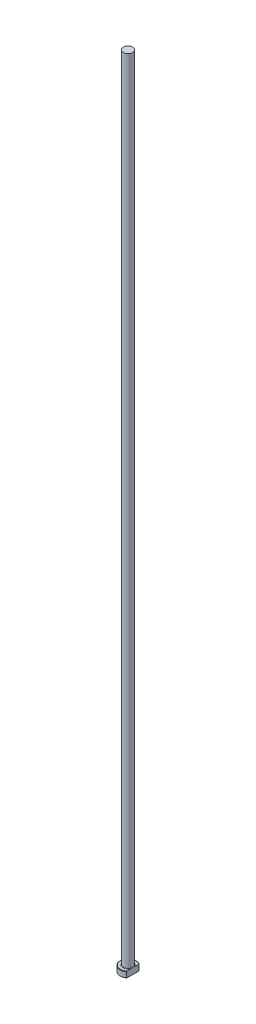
ISO-10303-21;
HEADER;
FILE_DESCRIPTION(('STEP AP214'),'2;1');
FILE_NAME('part.step','',(''),(''),'','','');
FILE_SCHEMA(('AUTOMOTIVE_DESIGN { 1 0 10303 214 1 1 1 1 }'));
ENDSEC;
DATA;
#1=APPLICATION_CONTEXT('core data for automotive mechanical design processes');
#2=APPLICATION_PROTOCOL_DEFINITION('international standard','automotive_design',2000,#1);
#3=PRODUCT_CONTEXT('',#1,'mechanical');
#4=PRODUCT('Part','Part','',(#3));
#5=PRODUCT_RELATED_PRODUCT_CATEGORY('part','',(#4));
#6=PRODUCT_DEFINITION_FORMATION('','',#4);
#7=PRODUCT_DEFINITION_CONTEXT('part definition',#1,'design');
#8=PRODUCT_DEFINITION('design','',#6,#7);
#9=PRODUCT_DEFINITION_SHAPE('','',#8);
#10=(LENGTH_UNIT() NAMED_UNIT(*) SI_UNIT(.MILLI.,.METRE.));
#11=(NAMED_UNIT(*) PLANE_ANGLE_UNIT() SI_UNIT($,.RADIAN.));
#12=(NAMED_UNIT(*) SI_UNIT($,.STERADIAN.) SOLID_ANGLE_UNIT());
#13=UNCERTAINTY_MEASURE_WITH_UNIT(LENGTH_MEASURE(1.E-05),#10,'distance_accuracy_value','');
#14=(GEOMETRIC_REPRESENTATION_CONTEXT(3) GLOBAL_UNCERTAINTY_ASSIGNED_CONTEXT((#13)) GLOBAL_UNIT_ASSIGNED_CONTEXT((#10,
#11,#12)) REPRESENTATION_CONTEXT('',''));
#15=CARTESIAN_POINT('',(0.,0.,0.));
#16=DIRECTION('',(0.,0.,1.));
#17=DIRECTION('',(1.,0.,0.));
#18=AXIS2_PLACEMENT_3D('',#15,#16,#17);
#19=CARTESIAN_POINT('',(0.,0.,0.));
#20=DIRECTION('',(0.,-1.,0.));
#21=DIRECTION('',(0.,0.,-1.));
#22=AXIS2_PLACEMENT_3D('',#19,#20,#21);
#23=PLANE('',#22);
#24=CARTESIAN_POINT('',(0.,0.,0.));
#25=DIRECTION('',(0.,-1.,0.));
#26=DIRECTION('',(0.,0.,-1.));
#27=AXIS2_PLACEMENT_3D('',#24,#25,#26);
#28=CIRCLE('',#27,3.80000000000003);
#29=CARTESIAN_POINT('',(2.34999999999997,0.,2.98621834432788));
#30=VERTEX_POINT('',#29);
#31=CARTESIAN_POINT('',(2.34999999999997,0.,-2.98621834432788));
#32=VERTEX_POINT('',#31);
#33=EDGE_CURVE('E98',#30,#32,#28,.T.);
#34=ORIENTED_EDGE('',*,*,#33,.T.);
#35=DIRECTION('',(0.,0.,1.));
#36=VECTOR('',#35,1.);
#37=CARTESIAN_POINT('',(2.34999999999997,0.,-3.23689666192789));
#38=LINE('',#37,#36);
#39=EDGE_CURVE('E83',#32,#30,#38,.T.);
#40=ORIENTED_EDGE('',*,*,#39,.T.);
#41=EDGE_LOOP('',(#34,#40));
#42=FACE_BOUND('',#41,.T.);
#43=ADVANCED_FACE('F32',(#42),#23,.T.);
#44=CARTESIAN_POINT('',(0.,259.958771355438,0.));
#45=DIRECTION('',(0.,1.,0.));
#46=DIRECTION('',(0.,0.,1.));
#47=AXIS2_PLACEMENT_3D('',#44,#45,#46);
#48=CYLINDRICAL_SURFACE('',#47,3.99999999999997);
#49=CARTESIAN_POINT('',(0.,2.80000000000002,0.));
#50=DIRECTION('',(0.,1.,0.));
#51=DIRECTION('',(0.,0.,1.));
#52=AXIS2_PLACEMENT_3D('',#49,#50,#51);
#53=CIRCLE('',#52,3.99999999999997);
#54=CARTESIAN_POINT('',(2.34999999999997,2.80000000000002,3.23689666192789));
#55=VERTEX_POINT('',#54);
#56=CARTESIAN_POINT('',(2.34999999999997,2.80000000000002,-3.23689666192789));
#57=VERTEX_POINT('',#56);
#58=EDGE_CURVE('E104',#55,#57,#53,.F.);
#59=ORIENTED_EDGE('',*,*,#58,.T.);
#60=DIRECTION('',(0.,-1.,0.));
#61=VECTOR('',#60,1.);
#62=CARTESIAN_POINT('',(2.34999999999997,400.,-3.23689666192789));
#63=LINE('',#62,#61);
#64=CARTESIAN_POINT('',(2.34999999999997,0.199999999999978,-3.23689666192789));
#65=VERTEX_POINT('',#64);
#66=EDGE_CURVE('E183',#57,#65,#63,.T.);
#67=ORIENTED_EDGE('',*,*,#66,.T.);
#68=CARTESIAN_POINT('',(0.,0.199999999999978,0.));
#69=DIRECTION('',(0.,-1.,0.));
#70=DIRECTION('',(0.,0.,-1.));
#71=AXIS2_PLACEMENT_3D('',#68,#69,#70);
#72=CIRCLE('',#71,3.99999999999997);
#73=CARTESIAN_POINT('',(2.34999999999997,0.199999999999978,3.23689666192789));
#74=VERTEX_POINT('',#73);
#75=EDGE_CURVE('E100',#65,#74,#72,.F.);
#76=ORIENTED_EDGE('',*,*,#75,.T.);
#77=DIRECTION('',(0.,-1.,0.));
#78=VECTOR('',#77,1.);
#79=CARTESIAN_POINT('',(2.34999999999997,400.,3.23689666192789));
#80=LINE('',#79,#78);
#81=EDGE_CURVE('E93',#55,#74,#80,.T.);
#82=ORIENTED_EDGE('',*,*,#81,.F.);
#83=EDGE_LOOP('',(#59,#67,#76,#82));
#84=FACE_BOUND('',#83,.T.);
#85=ADVANCED_FACE('F158',(#84),#48,.T.);
#86=CARTESIAN_POINT('',(-3.99999999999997,3.,0.));
#87=DIRECTION('',(0.,1.,0.));
#88=DIRECTION('',(0.,0.,1.));
#89=AXIS2_PLACEMENT_3D('',#86,#87,#88);
#90=PLANE('',#89);
#91=CARTESIAN_POINT('',(0.,3.,0.));
#92=DIRECTION('',(0.,1.,0.));
#93=DIRECTION('',(0.,0.,1.));
#94=AXIS2_PLACEMENT_3D('',#91,#92,#93);
#95=CIRCLE('',#94,3.80000000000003);
#96=CARTESIAN_POINT('',(2.34999999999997,3.,-2.98621834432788));
#97=VERTEX_POINT('',#96);
#98=CARTESIAN_POINT('',(2.34999999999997,3.,2.98621834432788));
#99=VERTEX_POINT('',#98);
#100=EDGE_CURVE('E178',#97,#99,#95,.T.);
#101=ORIENTED_EDGE('',*,*,#100,.T.);
#102=DIRECTION('',(0.,0.,-1.));
#103=VECTOR('',#102,1.);
#104=CARTESIAN_POINT('',(2.34999999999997,3.,0.));
#105=LINE('',#104,#103);
#106=CARTESIAN_POINT('',(2.34999999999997,2.99999999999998,0.989949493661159));
#107=VERTEX_POINT('',#106);
#108=EDGE_CURVE('E57',#99,#107,#105,.T.);
#109=ORIENTED_EDGE('',*,*,#108,.T.);
#110=CARTESIAN_POINT('',(0.,3.,0.));
#111=DIRECTION('',(0.,1.,0.));
#112=DIRECTION('',(0.,0.,1.));
#113=AXIS2_PLACEMENT_3D('',#110,#111,#112);
#114=CIRCLE('',#113,2.54999999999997);
#115=CARTESIAN_POINT('',(2.34999999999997,2.99999999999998,-0.98994949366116));
#116=VERTEX_POINT('',#115);
#117=EDGE_CURVE('E107',#107,#116,#114,.F.);
#118=ORIENTED_EDGE('',*,*,#117,.T.);
#119=EDGE_CURVE('E136',#116,#97,#105,.T.);
#120=ORIENTED_EDGE('',*,*,#119,.T.);
#121=EDGE_LOOP('',(#101,#109,#118,#120));
#122=FACE_BOUND('',#121,.T.);
#123=ADVANCED_FACE('F147',(#122),#90,.T.);
#124=CARTESIAN_POINT('',(0.,3.,0.));
#125=DIRECTION('',(0.,-1.,0.));
#126=DIRECTION('',(0.,0.,-1.));
#127=AXIS2_PLACEMENT_3D('',#124,#125,#126);
#128=CONICAL_SURFACE('',#127,3.80000000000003,0.785398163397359);
#129=ORIENTED_EDGE('',*,*,#58,.F.);
#130=CARTESIAN_POINT('',(2.34999999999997,-0.700856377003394,7.12322584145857));
#131=CARTESIAN_POINT('',(2.34999999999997,-0.58594192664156,7.00221702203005));
#132=CARTESIAN_POINT('',(2.34999999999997,-0.471176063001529,6.88106709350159));
#133=CARTESIAN_POINT('',(2.34999999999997,-0.241996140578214,6.63843358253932));
#134=CARTESIAN_POINT('',(2.34999999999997,-0.127582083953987,6.51694999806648));
#135=CARTESIAN_POINT('',(2.34999999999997,0.215169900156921,6.15179430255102));
#136=CARTESIAN_POINT('',(2.34999999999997,0.442895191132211,5.90754596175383));
#137=CARTESIAN_POINT('',(2.34999999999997,0.899497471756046,5.41318459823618));
#138=CARTESIAN_POINT('',(2.34999999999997,1.12833917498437,5.16303891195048));
#139=CARTESIAN_POINT('',(2.34999999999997,1.5824117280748,4.65967689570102));
#140=CARTESIAN_POINT('',(2.34999999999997,1.8076441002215,4.40646194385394));
#141=CARTESIAN_POINT('',(2.34999999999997,2.21600221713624,3.93721563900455));
#142=CARTESIAN_POINT('',(2.34999999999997,2.39996239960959,3.7219156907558));
#143=CARTESIAN_POINT('',(2.34999999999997,2.67143803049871,3.39502060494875));
#144=CARTESIAN_POINT('',(2.34999999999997,2.76124091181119,3.28532776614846));
#145=CARTESIAN_POINT('',(2.34999999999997,2.93886030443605,3.06434945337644));
#146=CARTESIAN_POINT('',(2.34999999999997,3.02667691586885,2.95306406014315));
#147=CARTESIAN_POINT('',(2.34999999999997,3.19949645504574,2.72877711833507));
#148=CARTESIAN_POINT('',(2.34999999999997,3.28450603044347,2.61578071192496));
#149=CARTESIAN_POINT('',(2.34999999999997,3.45108912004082,2.38722377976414));
#150=CARTESIAN_POINT('',(2.34999999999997,3.53266178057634,2.27166262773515));
#151=CARTESIAN_POINT('',(2.34999999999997,3.69088588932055,2.03753037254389));
#152=CARTESIAN_POINT('',(2.34999999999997,3.7675467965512,1.9189657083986));
#153=CARTESIAN_POINT('',(2.34999999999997,3.91413135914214,1.67777357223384));
#154=CARTESIAN_POINT('',(2.34999999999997,3.98405924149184,1.5551487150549));
#155=CARTESIAN_POINT('',(2.34999999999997,4.09761312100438,1.33668409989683));
#156=CARTESIAN_POINT('',(2.34999999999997,4.1434014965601,1.24197842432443));
#157=CARTESIAN_POINT('',(2.34999999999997,4.22781425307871,1.04934973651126));
#158=CARTESIAN_POINT('',(2.34999999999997,4.26643728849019,0.951426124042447));
#159=CARTESIAN_POINT('',(2.34999999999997,4.33394568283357,0.753323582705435));
#160=CARTESIAN_POINT('',(2.34999999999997,4.3629260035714,0.653177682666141));
#161=CARTESIAN_POINT('',(2.34999999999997,4.40928787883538,0.450234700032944));
#162=CARTESIAN_POINT('',(2.34999999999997,4.42667991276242,0.347440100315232));
#163=CARTESIAN_POINT('',(2.34999999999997,4.44509392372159,0.169206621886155));
#164=CARTESIAN_POINT('',(2.34999999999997,4.44931933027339,0.0940925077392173));
#165=CARTESIAN_POINT('',(2.34999999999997,4.45052785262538,-0.0561912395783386));
#166=CARTESIAN_POINT('',(2.34999999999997,4.4475119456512,-0.13136086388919));
#167=CARTESIAN_POINT('',(2.34999999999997,4.43440638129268,-0.281306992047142));
#168=CARTESIAN_POINT('',(2.34999999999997,4.42429455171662,-0.356081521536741));
#169=CARTESIAN_POINT('',(2.34999999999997,4.39757556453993,-0.504456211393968));
#170=CARTESIAN_POINT('',(2.34999999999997,4.38096681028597,-0.578056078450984));
#171=CARTESIAN_POINT('',(2.34999999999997,4.3332884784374,-0.756675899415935));
#172=CARTESIAN_POINT('',(2.34999999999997,4.29907594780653,-0.860854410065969));
#173=CARTESIAN_POINT('',(2.34999999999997,4.22140056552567,-1.06568624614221));
#174=CARTESIAN_POINT('',(2.34999999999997,4.17793098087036,-1.16633694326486));
#175=CARTESIAN_POINT('',(2.34999999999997,4.08383876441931,-1.36480952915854));
#176=CARTESIAN_POINT('',(2.34999999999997,4.03318169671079,-1.46261489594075));
#177=CARTESIAN_POINT('',(2.34999999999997,3.95330034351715,-1.60710986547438));
#178=CARTESIAN_POINT('',(2.34999999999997,3.92602819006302,-1.65489920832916));
#179=CARTESIAN_POINT('',(2.34999999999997,3.8703483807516,-1.74981001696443));
#180=CARTESIAN_POINT('',(2.34999999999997,3.84194077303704,-1.79693151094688));
#181=CARTESIAN_POINT('',(2.34999999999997,3.74736854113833,-1.95015020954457));
#182=CARTESIAN_POINT('',(2.34999999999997,3.67916021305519,-2.05498710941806));
#183=CARTESIAN_POINT('',(2.34999999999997,3.53901640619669,-2.26214963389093));
#184=CARTESIAN_POINT('',(2.34999999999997,3.46708001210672,-2.36447463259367));
#185=CARTESIAN_POINT('',(2.34999999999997,3.32034981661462,-2.56716934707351));
#186=CARTESIAN_POINT('',(2.34999999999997,3.24555383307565,-2.66753747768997));
#187=CARTESIAN_POINT('',(2.34999999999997,3.09379905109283,-2.8666288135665));
#188=CARTESIAN_POINT('',(2.34999999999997,3.0168401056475,-2.96535190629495));
#189=CARTESIAN_POINT('',(2.34999999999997,2.78304279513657,-3.26004190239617));
#190=CARTESIAN_POINT('',(2.34999999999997,2.62367547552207,-3.45399979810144));
#191=CARTESIAN_POINT('',(2.34999999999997,2.30072524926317,-3.83818937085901));
#192=CARTESIAN_POINT('',(2.34999999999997,2.13714428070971,-4.02842269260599));
#193=CARTESIAN_POINT('',(2.34999999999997,1.80677758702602,-4.40661405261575));
#194=CARTESIAN_POINT('',(2.34999999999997,1.6399871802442,-4.59456799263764));
#195=CARTESIAN_POINT('',(2.34999999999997,1.30429273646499,-4.96860985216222));
#196=CARTESIAN_POINT('',(2.34999999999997,1.13538847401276,-5.15469756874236));
#197=CARTESIAN_POINT('',(2.34999999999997,0.796258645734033,-5.52521155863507));
#198=CARTESIAN_POINT('',(2.34999999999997,0.626035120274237,-5.70963970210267));
#199=CARTESIAN_POINT('',(2.34999999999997,0.284419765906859,-6.07741061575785));
#200=CARTESIAN_POINT('',(2.34999999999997,0.113027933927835,-6.26075338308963));
#201=CARTESIAN_POINT('',(2.34999999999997,-0.112202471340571,-6.50049374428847));
#202=CARTESIAN_POINT('',(2.34999999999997,-0.165631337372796,-6.55727687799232));
#203=CARTESIAN_POINT('',(2.34999999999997,-0.272578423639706,-6.67077412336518));
#204=CARTESIAN_POINT('',(2.34999999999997,-0.326096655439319,-6.72748822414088));
#205=CARTESIAN_POINT('',(2.34999999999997,-0.433118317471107,-6.84074875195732));
#206=CARTESIAN_POINT('',(2.34999999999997,-0.486621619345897,-6.89729530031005));
#207=CARTESIAN_POINT('',(2.34999999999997,-0.593691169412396,-7.01031353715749));
#208=CARTESIAN_POINT('',(2.34999999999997,-0.647257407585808,-7.0667852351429));
#209=CARTESIAN_POINT('',(2.34999999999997,-0.700856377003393,-7.12322584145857));
#210=B_SPLINE_CURVE_WITH_KNOTS('',3,(#130,#131,#132,#133,#134,#135,#136,#137,#138,#139,#140,
#141,#142,#143,#144,#145,#146,#147,#148,#149,#150,#151,#152,#153,#154,#155,#156,#157,#158,#159,
#160,#161,#162,#163,#164,#165,#166,#167,#168,#169,#170,#171,#172,#173,#174,#175,#176,#177,#178,
#179,#180,#181,#182,#183,#184,#185,#186,#187,#188,#189,#190,#191,#192,#193,#194,#195,#196,#197,
#198,#199,#200,#201,#202,#203,#204,#205,#206,#207,#208,#209),.UNSPECIFIED.,.F.,.F.,(4,2,2,2,2,2,
2,2,2,2,2,2,2,2,2,2,2,2,2,2,2,2,2,2,2,2,2,2,2,2,2,2,2,2,2,2,2,2,2,4),(0.,0.500635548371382,
1.00127416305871,2.00308434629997,3.0201530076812,4.03678077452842,4.88626044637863,
5.31153593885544,5.73678994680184,6.16095168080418,6.58521815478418,7.00864136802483,
7.43179699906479,7.74715928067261,8.0625807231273,8.37479699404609,8.68673054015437,
8.91210094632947,9.13744094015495,9.36348819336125,9.58959103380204,9.91793468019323,
10.2465179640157,10.5767323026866,10.7417913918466,10.9068434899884,11.2819382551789,
11.6571255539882,12.032605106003,12.4081102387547,13.1610954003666,13.9137401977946,
14.6675815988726,15.4215040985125,16.174430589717,16.9273590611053,17.1612622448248,
17.3951984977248,17.6287386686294,17.8622456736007),.UNSPECIFIED.);
#211=EDGE_CURVE('E135',#55,#99,#210,.T.);
#212=ORIENTED_EDGE('',*,*,#211,.T.);
#213=ORIENTED_EDGE('',*,*,#100,.F.);
#214=EDGE_CURVE('E127',#97,#57,#210,.T.);
#215=ORIENTED_EDGE('',*,*,#214,.T.);
#216=EDGE_LOOP('',(#129,#212,#213,#215));
#217=FACE_BOUND('',#216,.T.);
#218=ADVANCED_FACE('F143',(#217),#128,.T.);
#219=CARTESIAN_POINT('',(0.,0.199999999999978,0.));
#220=DIRECTION('',(0.,1.,0.));
#221=DIRECTION('',(0.,0.,1.));
#222=AXIS2_PLACEMENT_3D('',#219,#220,#221);
#223=CONICAL_SURFACE('',#222,3.99999999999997,0.785398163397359);
#224=ORIENTED_EDGE('',*,*,#75,.F.);
#225=CARTESIAN_POINT('',(2.34999999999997,3.7008563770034,-7.12322584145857));
#226=CARTESIAN_POINT('',(2.34999999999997,3.58594192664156,-7.00221702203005));
#227=CARTESIAN_POINT('',(2.34999999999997,3.47117606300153,-6.88106709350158));
#228=CARTESIAN_POINT('',(2.34999999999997,3.24199614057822,-6.63843358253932));
#229=CARTESIAN_POINT('',(2.34999999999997,3.12758208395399,-6.51694999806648));
#230=CARTESIAN_POINT('',(2.34999999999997,2.78483009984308,-6.15179430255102));
#231=CARTESIAN_POINT('',(2.34999999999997,2.55710480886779,-5.90754596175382));
#232=CARTESIAN_POINT('',(2.34999999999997,2.10050252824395,-5.41318459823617));
#233=CARTESIAN_POINT('',(2.34999999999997,1.87166082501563,-5.16303891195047));
#234=CARTESIAN_POINT('',(2.34999999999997,1.41758827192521,-4.65967689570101));
#235=CARTESIAN_POINT('',(2.34999999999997,1.1923558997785,-4.40646194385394));
#236=CARTESIAN_POINT('',(2.34999999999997,0.783997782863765,-3.93721563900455));
#237=CARTESIAN_POINT('',(2.34999999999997,0.60003760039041,-3.7219156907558));
#238=CARTESIAN_POINT('',(2.34999999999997,0.328561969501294,-3.39502060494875));
#239=CARTESIAN_POINT('',(2.34999999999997,0.238759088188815,-3.28532776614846));
#240=CARTESIAN_POINT('',(2.34999999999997,0.061139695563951,-3.06434945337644));
#241=CARTESIAN_POINT('',(2.34999999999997,-0.0266769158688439,-2.95306406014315));
#242=CARTESIAN_POINT('',(2.34999999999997,-0.199496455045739,-2.72877711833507));
#243=CARTESIAN_POINT('',(2.34999999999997,-0.284506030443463,-2.61578071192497));
#244=CARTESIAN_POINT('',(2.34999999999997,-0.451089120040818,-2.38722377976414));
#245=CARTESIAN_POINT('',(2.34999999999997,-0.532661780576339,-2.27166262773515));
#246=CARTESIAN_POINT('',(2.34999999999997,-0.690885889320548,-2.0375303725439));
#247=CARTESIAN_POINT('',(2.34999999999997,-0.767546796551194,-1.91896570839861));
#248=CARTESIAN_POINT('',(2.34999999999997,-0.914131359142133,-1.67777357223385));
#249=CARTESIAN_POINT('',(2.34999999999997,-0.984059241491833,-1.5551487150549));
#250=CARTESIAN_POINT('',(2.34999999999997,-1.09761312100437,-1.33668409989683));
#251=CARTESIAN_POINT('',(2.34999999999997,-1.1434014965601,-1.24197842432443));
#252=CARTESIAN_POINT('',(2.34999999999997,-1.22781425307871,-1.04934973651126));
#253=CARTESIAN_POINT('',(2.34999999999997,-1.26643728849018,-0.951426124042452));
#254=CARTESIAN_POINT('',(2.34999999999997,-1.33394568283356,-0.75332358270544));
#255=CARTESIAN_POINT('',(2.34999999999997,-1.3629260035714,-0.653177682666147));
#256=CARTESIAN_POINT('',(2.34999999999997,-1.40928787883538,-0.450234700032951));
#257=CARTESIAN_POINT('',(2.34999999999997,-1.42667991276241,-0.347440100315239));
#258=CARTESIAN_POINT('',(2.34999999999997,-1.44509392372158,-0.169206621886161));
#259=CARTESIAN_POINT('',(2.34999999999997,-1.44931933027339,-0.0940925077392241));
#260=CARTESIAN_POINT('',(2.34999999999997,-1.45052785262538,0.0561912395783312));
#261=CARTESIAN_POINT('',(2.34999999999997,-1.4475119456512,0.131360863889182));
#262=CARTESIAN_POINT('',(2.34999999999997,-1.43440638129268,0.281306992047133));
#263=CARTESIAN_POINT('',(2.34999999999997,-1.42429455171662,0.356081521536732));
#264=CARTESIAN_POINT('',(2.34999999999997,-1.39757556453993,0.504456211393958));
#265=CARTESIAN_POINT('',(2.34999999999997,-1.38096681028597,0.578056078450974));
#266=CARTESIAN_POINT('',(2.34999999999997,-1.3332884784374,0.756675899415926));
#267=CARTESIAN_POINT('',(2.34999999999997,-1.29907594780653,0.86085441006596));
#268=CARTESIAN_POINT('',(2.34999999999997,-1.22140056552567,1.0656862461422));
#269=CARTESIAN_POINT('',(2.34999999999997,-1.17793098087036,1.16633694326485));
#270=CARTESIAN_POINT('',(2.34999999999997,-1.08383876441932,1.36480952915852));
#271=CARTESIAN_POINT('',(2.34999999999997,-1.0331816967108,1.46261489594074));
#272=CARTESIAN_POINT('',(2.34999999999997,-0.953300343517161,1.60710986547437));
#273=CARTESIAN_POINT('',(2.34999999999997,-0.926028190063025,1.65489920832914));
#274=CARTESIAN_POINT('',(2.34999999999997,-0.87034838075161,1.74981001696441));
#275=CARTESIAN_POINT('',(2.34999999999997,-0.841940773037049,1.79693151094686));
#276=CARTESIAN_POINT('',(2.34999999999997,-0.747368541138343,1.95015020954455));
#277=CARTESIAN_POINT('',(2.34999999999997,-0.679160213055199,2.05498710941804));
#278=CARTESIAN_POINT('',(2.34999999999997,-0.539016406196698,2.26214963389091));
#279=CARTESIAN_POINT('',(2.34999999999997,-0.467080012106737,2.36447463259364));
#280=CARTESIAN_POINT('',(2.34999999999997,-0.320349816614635,2.56716934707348));
#281=CARTESIAN_POINT('',(2.34999999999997,-0.245553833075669,2.66753747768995));
#282=CARTESIAN_POINT('',(2.34999999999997,-0.0937990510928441,2.86662881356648));
#283=CARTESIAN_POINT('',(2.34999999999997,-0.0168401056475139,2.96535190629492));
#284=CARTESIAN_POINT('',(2.34999999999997,0.216957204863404,3.26004190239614));
#285=CARTESIAN_POINT('',(2.34999999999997,0.376324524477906,3.45399979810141));
#286=CARTESIAN_POINT('',(2.34999999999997,0.699274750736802,3.83818937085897));
#287=CARTESIAN_POINT('',(2.34999999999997,0.862855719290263,4.02842269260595));
#288=CARTESIAN_POINT('',(2.34999999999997,1.19322241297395,4.40661405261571));
#289=CARTESIAN_POINT('',(2.34999999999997,1.36001281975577,4.5945679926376));
#290=CARTESIAN_POINT('',(2.34999999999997,1.69570726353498,4.96860985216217));
#291=CARTESIAN_POINT('',(2.34999999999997,1.8646115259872,5.15469756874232));
#292=CARTESIAN_POINT('',(2.34999999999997,2.20374135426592,5.52521155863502));
#293=CARTESIAN_POINT('',(2.34999999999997,2.37396487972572,5.70963970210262));
#294=CARTESIAN_POINT('',(2.34999999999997,2.71558023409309,6.07741061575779));
#295=CARTESIAN_POINT('',(2.34999999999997,2.88697206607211,6.26075338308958));
#296=CARTESIAN_POINT('',(2.34999999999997,3.11220247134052,6.50049374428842));
#297=CARTESIAN_POINT('',(2.34999999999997,3.16563133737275,6.55727687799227));
#298=CARTESIAN_POINT('',(2.34999999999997,3.27257842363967,6.67077412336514));
#299=CARTESIAN_POINT('',(2.34999999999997,3.32609665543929,6.72748822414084));
#300=CARTESIAN_POINT('',(2.34999999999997,3.43311831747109,6.84074875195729));
#301=CARTESIAN_POINT('',(2.34999999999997,3.48662161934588,6.89729530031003));
#302=CARTESIAN_POINT('',(2.34999999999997,3.59369116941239,7.01031353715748));
#303=CARTESIAN_POINT('',(2.34999999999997,3.64725740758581,7.06678523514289));
#304=CARTESIAN_POINT('',(2.34999999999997,3.7008563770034,7.12322584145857));
#305=B_SPLINE_CURVE_WITH_KNOTS('',3,(#225,#226,#227,#228,#229,#230,#231,#232,#233,#234,#235,
#236,#237,#238,#239,#240,#241,#242,#243,#244,#245,#246,#247,#248,#249,#250,#251,#252,#253,#254,
#255,#256,#257,#258,#259,#260,#261,#262,#263,#264,#265,#266,#267,#268,#269,#270,#271,#272,#273,
#274,#275,#276,#277,#278,#279,#280,#281,#282,#283,#284,#285,#286,#287,#288,#289,#290,#291,#292,
#293,#294,#295,#296,#297,#298,#299,#300,#301,#302,#303,#304),.UNSPECIFIED.,.F.,.F.,(4,2,2,2,2,2,
2,2,2,2,2,2,2,2,2,2,2,2,2,2,2,2,2,2,2,2,2,2,2,2,2,2,2,2,2,2,2,2,2,4),(0.,0.500635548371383,
1.00127416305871,2.00308434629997,3.0201530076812,4.03678077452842,4.88626044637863,
5.31153593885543,5.73678994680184,6.16095168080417,6.58521815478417,7.00864136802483,
7.43179699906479,7.7471592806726,8.0625807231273,8.37479699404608,8.68673054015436,
8.91210094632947,9.13744094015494,9.36348819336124,9.58959103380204,9.91793468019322,
10.2465179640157,10.5767323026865,10.7417913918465,10.9068434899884,11.2819382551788,
11.6571255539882,12.032605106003,12.4081102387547,13.1610954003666,13.9137401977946,
14.6675815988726,15.4215040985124,16.1744305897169,16.9273590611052,17.1612622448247,
17.3951984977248,17.6287386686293,17.8622456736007),.UNSPECIFIED.);
#306=EDGE_CURVE('E86',#65,#32,#305,.T.);
#307=ORIENTED_EDGE('',*,*,#306,.T.);
#308=ORIENTED_EDGE('',*,*,#33,.F.);
#309=EDGE_CURVE('E89',#30,#74,#305,.T.);
#310=ORIENTED_EDGE('',*,*,#309,.T.);
#311=EDGE_LOOP('',(#224,#307,#308,#310));
#312=FACE_BOUND('',#311,.T.);
#313=ADVANCED_FACE('F97',(#312),#223,.T.);
#314=CARTESIAN_POINT('',(0.,3.19999999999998,0.));
#315=DIRECTION('',(0.,1.,0.));
#316=DIRECTION('',(0.,0.,1.));
#317=AXIS2_PLACEMENT_3D('',#314,#315,#316);
#318=TOROIDAL_SURFACE('',#317,2.54999999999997,0.2);
#319=CARTESIAN_POINT('',(2.34999999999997,3.19999999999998,0.));
#320=CARTESIAN_POINT('',(2.34999999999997,3.20000050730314,3.97301915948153E-11));
#321=CARTESIAN_POINT('',(2.34999999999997,3.20000101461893,-1.63653131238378E-07));
#322=CARTESIAN_POINT('',(2.34999999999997,3.20000197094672,-6.37225615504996E-07));
#323=CARTESIAN_POINT('',(2.34999999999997,3.20000241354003,-9.56393877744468E-07));
#324=CARTESIAN_POINT('',(2.34999999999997,3.20000331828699,-1.71856519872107E-06));
#325=CARTESIAN_POINT('',(2.34999999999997,3.20000377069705,-2.17342707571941E-06));
#326=CARTESIAN_POINT('',(2.34999999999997,3.20000459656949,-3.12835726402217E-06));
#327=CARTESIAN_POINT('',(2.34999999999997,3.20000497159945,-3.62715530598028E-06));
#328=CARTESIAN_POINT('',(2.34999999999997,3.20000632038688,-5.51226928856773E-06));
#329=CARTESIAN_POINT('',(2.34999999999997,3.20000721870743,-6.95455039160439E-06));
#330=CARTESIAN_POINT('',(2.34999999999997,3.20000873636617,-9.84867466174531E-06));
#331=CARTESIAN_POINT('',(2.34999999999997,3.20000937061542,-1.12930741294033E-05));
#332=CARTESIAN_POINT('',(2.34999999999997,3.20001195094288,-1.72675053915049E-05));
#333=CARTESIAN_POINT('',(2.34999999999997,3.20001382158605,-2.18342580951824E-05));
#334=CARTESIAN_POINT('',(2.34999999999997,3.20001665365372,-3.0562235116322E-05));
#335=CARTESIAN_POINT('',(2.34999999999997,3.20001770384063,-3.46947501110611E-05));
#336=CARTESIAN_POINT('',(2.34999999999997,3.20002522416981,-6.49852707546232E-05));
#337=CARTESIAN_POINT('',(2.34999999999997,3.20003079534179,-9.1319424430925E-05));
#338=CARTESIAN_POINT('',(2.34999999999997,3.20005517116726,-0.000194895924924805));
#339=CARTESIAN_POINT('',(2.34999999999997,3.20007855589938,-0.000271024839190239));
#340=CARTESIAN_POINT('',(2.34999999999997,3.20016914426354,-0.000571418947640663));
#341=CARTESIAN_POINT('',(2.34999999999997,3.20023327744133,-0.000796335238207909));
#342=CARTESIAN_POINT('',(2.34999999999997,3.20048915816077,-0.00168650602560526));
#343=CARTESIAN_POINT('',(2.34999999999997,3.20068469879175,-0.00235093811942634));
#344=CARTESIAN_POINT('',(2.34999999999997,3.2014949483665,-0.00511204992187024));
#345=CARTESIAN_POINT('',(2.34999999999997,3.20210492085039,-0.00720975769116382));
#346=CARTESIAN_POINT('',(2.34999999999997,3.20787958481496,-0.0270590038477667));
#347=CARTESIAN_POINT('',(2.34999999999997,3.21306460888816,-0.0448062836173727));
#348=CARTESIAN_POINT('',(2.34999999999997,3.22319239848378,-0.0796159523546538));
#349=CARTESIAN_POINT('',(2.34999999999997,3.22813669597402,-0.0966779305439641));
#350=CARTESIAN_POINT('',(2.34999999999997,3.23859474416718,-0.132940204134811));
#351=CARTESIAN_POINT('',(2.34999999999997,3.24410273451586,-0.152142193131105));
#352=CARTESIAN_POINT('',(2.34999999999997,3.25508732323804,-0.190778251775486));
#353=CARTESIAN_POINT('',(2.34999999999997,3.260562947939,-0.210212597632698));
#354=CARTESIAN_POINT('',(2.34999999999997,3.27370944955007,-0.257444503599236));
#355=CARTESIAN_POINT('',(2.34999999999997,3.28131640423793,-0.285259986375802));
#356=CARTESIAN_POINT('',(2.34999999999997,3.29598901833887,-0.340268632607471));
#357=CARTESIAN_POINT('',(2.34999999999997,3.30306356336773,-0.367459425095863));
#358=CARTESIAN_POINT('',(2.34999999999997,3.32130563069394,-0.439911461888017));
#359=CARTESIAN_POINT('',(2.34999999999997,3.33209700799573,-0.485269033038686));
#360=CARTESIAN_POINT('',(2.34999999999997,3.35207859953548,-0.576761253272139));
#361=CARTESIAN_POINT('',(2.34999999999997,3.36125388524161,-0.622899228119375));
#362=CARTESIAN_POINT('',(2.34999999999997,3.37792670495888,-0.719572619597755));
#363=CARTESIAN_POINT('',(2.34999999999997,3.3852125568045,-0.770145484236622));
#364=CARTESIAN_POINT('',(2.34999999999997,3.39588167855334,-0.87157933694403));
#365=CARTESIAN_POINT('',(2.34999999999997,3.39927813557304,-0.92243876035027));
#366=CARTESIAN_POINT('',(2.34999999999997,3.4002008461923,-0.998268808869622));
#367=CARTESIAN_POINT('',(2.34999999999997,3.39983763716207,-1.02321254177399));
#368=CARTESIAN_POINT('',(2.34999999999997,3.39747624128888,-1.07301750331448));
#369=CARTESIAN_POINT('',(2.34999999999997,3.3954790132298,-1.09787877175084));
#370=CARTESIAN_POINT('',(2.34999999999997,3.38951136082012,-1.14688451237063));
#371=CARTESIAN_POINT('',(2.34999999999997,3.38557982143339,-1.17103355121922));
#372=CARTESIAN_POINT('',(2.34999999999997,3.37522613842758,-1.21877292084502));
#373=CARTESIAN_POINT('',(2.34999999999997,3.36880975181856,-1.24236441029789));
#374=CARTESIAN_POINT('',(2.34999999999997,3.3551050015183,-1.28139211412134));
#375=CARTESIAN_POINT('',(2.34999999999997,3.34867539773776,-1.29712639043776));
#376=CARTESIAN_POINT('',(2.34999999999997,3.33376103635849,-1.32763329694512));
#377=CARTESIAN_POINT('',(2.34999999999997,3.32527759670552,-1.34240653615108));
#378=CARTESIAN_POINT('',(2.34999999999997,3.30996401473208,-1.36406737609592));
#379=CARTESIAN_POINT('',(2.34999999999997,3.30402750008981,-1.37158321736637));
#380=CARTESIAN_POINT('',(2.34999999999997,3.29119867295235,-1.38575961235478));
#381=CARTESIAN_POINT('',(2.34999999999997,3.28430748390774,-1.39242115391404));
#382=CARTESIAN_POINT('',(2.34999999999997,3.27111764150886,-1.40316348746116));
#383=CARTESIAN_POINT('',(2.34999999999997,3.26502095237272,-1.40748979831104));
#384=CARTESIAN_POINT('',(2.34999999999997,3.25221216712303,-1.41511389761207));
#385=CARTESIAN_POINT('',(2.34999999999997,3.24550106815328,-1.41841331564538));
#386=CARTESIAN_POINT('',(2.34999999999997,3.23285600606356,-1.42321218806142));
#387=CARTESIAN_POINT('',(2.34999999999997,3.22700595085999,-1.42493102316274));
#388=CARTESIAN_POINT('',(2.34999999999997,3.21509932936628,-1.42735933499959));
#389=CARTESIAN_POINT('',(2.34999999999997,3.20904291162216,-1.42806952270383));
#390=CARTESIAN_POINT('',(2.34999999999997,3.19688696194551,-1.42841721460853));
#391=CARTESIAN_POINT('',(2.34999999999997,3.19078736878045,-1.42805261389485));
#392=CARTESIAN_POINT('',(2.34999999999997,3.17874187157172,-1.42628029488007));
#393=CARTESIAN_POINT('',(2.34999999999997,3.17279604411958,-1.42487206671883));
#394=CARTESIAN_POINT('',(2.34999999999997,3.16130302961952,-1.42116093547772));
#395=CARTESIAN_POINT('',(2.34999999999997,3.15575093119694,-1.41887295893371));
#396=CARTESIAN_POINT('',(2.34999999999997,3.1450217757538,-1.41355066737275));
#397=CARTESIAN_POINT('',(2.34999999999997,3.13984483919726,-1.41051611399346));
#398=CARTESIAN_POINT('',(2.34999999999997,3.12662898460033,-1.40165617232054));
#399=CARTESIAN_POINT('',(2.34999999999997,3.11894184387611,-1.39530630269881));
#400=CARTESIAN_POINT('',(2.34999999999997,3.10463862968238,-1.38149172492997));
#401=CARTESIAN_POINT('',(2.34999999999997,3.098026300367,-1.3740232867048));
#402=CARTESIAN_POINT('',(2.34999999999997,3.08144643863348,-1.35283380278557));
#403=CARTESIAN_POINT('',(2.34999999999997,3.07238753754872,-1.33840776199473));
#404=CARTESIAN_POINT('',(2.34999999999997,3.05644883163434,-1.30845169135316));
#405=CARTESIAN_POINT('',(2.34999999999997,3.04957029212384,-1.29292102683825));
#406=CARTESIAN_POINT('',(2.34999999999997,3.03757508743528,-1.26136930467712));
#407=CARTESIAN_POINT('',(2.34999999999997,3.03244275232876,-1.24535409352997));
#408=CARTESIAN_POINT('',(2.34999999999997,3.02353297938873,-1.21294404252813));
#409=CARTESIAN_POINT('',(2.34999999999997,3.01975697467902,-1.19654882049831));
#410=CARTESIAN_POINT('',(2.34999999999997,3.01003121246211,-1.14664956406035));
#411=CARTESIAN_POINT('',(2.34999999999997,3.00581272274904,-1.11281111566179));
#412=CARTESIAN_POINT('',(2.34999999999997,2.9993669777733,-1.02798337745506));
#413=CARTESIAN_POINT('',(2.34999999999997,2.99918477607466,-0.976864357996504));
#414=CARTESIAN_POINT('',(2.34999999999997,3.00375848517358,-0.874705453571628));
#415=CARTESIAN_POINT('',(2.34999999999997,3.00853512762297,-0.823666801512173));
#416=CARTESIAN_POINT('',(2.34999999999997,3.02118536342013,-0.725382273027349));
#417=CARTESIAN_POINT('',(2.34999999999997,3.02883644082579,-0.678106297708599));
#418=CARTESIAN_POINT('',(2.34999999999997,3.04631118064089,-0.584387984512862));
#419=CARTESIAN_POINT('',(2.34999999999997,3.05611566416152,-0.537941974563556));
#420=CARTESIAN_POINT('',(2.34999999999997,3.07458329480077,-0.457342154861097));
#421=CARTESIAN_POINT('',(2.34999999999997,3.08288953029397,-0.423104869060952));
#422=CARTESIAN_POINT('',(2.34999999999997,3.100392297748,-0.353909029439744));
#423=CARTESIAN_POINT('',(2.34999999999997,3.10960639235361,-0.318954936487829));
#424=CARTESIAN_POINT('',(2.34999999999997,3.12565453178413,-0.259778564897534));
#425=CARTESIAN_POINT('',(2.34999999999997,3.13236140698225,-0.235521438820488));
#426=CARTESIAN_POINT('',(2.34999999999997,3.14587896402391,-0.187317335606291));
#427=CARTESIAN_POINT('',(2.34999999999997,3.15268775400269,-0.163369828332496));
#428=CARTESIAN_POINT('',(2.34999999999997,3.1656491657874,-0.118168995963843));
#429=CARTESIAN_POINT('',(2.34999999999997,3.17179049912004,-0.0969123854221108));
#430=CARTESIAN_POINT('',(2.34999999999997,3.18438963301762,-0.0535409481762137));
#431=CARTESIAN_POINT('',(2.34999999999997,3.19085004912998,-0.0314268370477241));
#432=CARTESIAN_POINT('',(2.34999999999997,3.19789544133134,-0.00720839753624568));
#433=CARTESIAN_POINT('',(2.34999999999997,3.19850583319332,-0.00510934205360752));
#434=CARTESIAN_POINT('',(2.34999999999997,3.19931618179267,-0.00234791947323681));
#435=CARTESIAN_POINT('',(2.34999999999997,3.19951141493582,-0.00168452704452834));
#436=CARTESIAN_POINT('',(2.34999999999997,3.19976692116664,-0.000795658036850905));
#437=CARTESIAN_POINT('',(2.34999999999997,3.19983097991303,-0.000571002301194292));
#438=CARTESIAN_POINT('',(2.34999999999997,3.19992147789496,-0.000270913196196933));
#439=CARTESIAN_POINT('',(2.34999999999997,3.19994484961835,-0.000194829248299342));
#440=CARTESIAN_POINT('',(2.34999999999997,3.19996921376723,-9.13049088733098E-05));
#441=CARTESIAN_POINT('',(2.34999999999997,3.19997478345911,-6.49772799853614E-05));
#442=CARTESIAN_POINT('',(2.34999999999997,3.19998230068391,-3.46933684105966E-05));
#443=CARTESIAN_POINT('',(2.34999999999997,3.19998335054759,-3.0561236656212E-05));
#444=CARTESIAN_POINT('',(2.34999999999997,3.19998618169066,-2.18340265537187E-05));
#445=CARTESIAN_POINT('',(2.34999999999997,3.19998805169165,-1.72676374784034E-05));
#446=CARTESIAN_POINT('',(2.34999999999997,3.19999063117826,-1.1293576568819E-05));
#447=CARTESIAN_POINT('',(2.34999999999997,3.19999126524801,-9.84920577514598E-06));
#448=CARTESIAN_POINT('',(2.34999999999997,3.19999278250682,-6.95510752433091E-06));
#449=CARTESIAN_POINT('',(2.34999999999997,3.19999368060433,-5.51282056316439E-06));
#450=CARTESIAN_POINT('',(2.34999999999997,3.1999950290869,-3.62766169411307E-06));
#451=CARTESIAN_POINT('',(2.34999999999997,3.19999540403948,-3.12884229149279E-06));
#452=CARTESIAN_POINT('',(2.34999999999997,3.19999622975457,-2.1738554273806E-06));
#453=CARTESIAN_POINT('',(2.34999999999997,3.19999668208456,-1.71895785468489E-06));
#454=CARTESIAN_POINT('',(2.34999999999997,3.19999758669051,-9.56701781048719E-07));
#455=CARTESIAN_POINT('',(2.34999999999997,3.19999802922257,-6.37487274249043E-07));
#456=CARTESIAN_POINT('',(2.34999999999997,3.19999898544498,-1.63799559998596E-07));
#457=CARTESIAN_POINT('',(2.34999999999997,3.19999949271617,-3.97286763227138E-11));
#458=CARTESIAN_POINT('',(2.34999999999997,3.19999999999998,0.));
#459=B_SPLINE_CURVE_WITH_KNOTS('',3,(#319,#320,#321,#322,#323,#324,#325,#326,#327,#328,#329,
#330,#331,#332,#333,#334,#335,#336,#337,#338,#339,#340,#341,#342,#343,#344,#345,#346,#347,#348,
#349,#350,#351,#352,#353,#354,#355,#356,#357,#358,#359,#360,#361,#362,#363,#364,#365,#366,#367,
#368,#369,#370,#371,#372,#373,#374,#375,#376,#377,#378,#379,#380,#381,#382,#383,#384,#385,#386,
#387,#388,#389,#390,#391,#392,#393,#394,#395,#396,#397,#398,#399,#400,#401,#402,#403,#404,#405,
#406,#407,#408,#409,#410,#411,#412,#413,#414,#415,#416,#417,#418,#419,#420,#421,#422,#423,#424,
#425,#426,#427,#428,#429,#430,#431,#432,#433,#434,#435,#436,#437,#438,#439,#440,#441,#442,#443,
#444,#445,#446,#447,#448,#449,#450,#451,#452,#453,#454,#455,#456,#457,#458),.UNSPECIFIED.,.T.,
.F.,(4,2,2,2,2,2,2,2,2,2,2,2,2,2,2,2,2,2,2,2,2,2,2,2,2,2,2,2,2,2,2,2,2,2,2,2,2,2,2,2,2,2,2,2,2,
2,2,2,2,2,2,2,2,2,2,2,2,2,2,2,2,2,2,2,2,2,2,2,2,4),(0.,1.52815233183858E-06,
3.16151347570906E-06,5.07598848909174E-06,6.94672329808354E-06,1.20236100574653E-05,
1.67522119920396E-05,3.15258107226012E-05,4.43009343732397E-05,0.000125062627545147,
0.000363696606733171,0.00106562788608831,0.00314310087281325,0.00969727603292,
0.0651627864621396,0.118455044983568,0.178383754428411,0.23895657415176,0.325465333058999,
0.409751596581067,0.549599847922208,0.690678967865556,0.843870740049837,0.996541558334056,
1.07134060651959,1.14609579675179,1.21940608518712,1.29254753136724,1.34344322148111,
1.3943063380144,1.42297722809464,1.45161466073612,1.47396609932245,1.49628188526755,
1.51449565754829,1.5326965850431,1.55093318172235,1.56917869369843,1.5871274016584,
1.60508184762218,1.63482087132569,1.66466136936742,1.71547705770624,1.76632218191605,
1.81669819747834,1.86712728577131,1.96917546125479,2.12216244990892,2.27579162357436,
2.41939223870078,2.56176232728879,2.667446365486,2.77588510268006,2.85138624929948,
2.92607549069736,2.99245400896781,3.06156674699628,3.06812515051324,3.0701993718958,
3.07090048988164,3.07113898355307,3.07121972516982,3.07123249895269,3.07124727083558,
3.07125199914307,3.07125707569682,3.07125894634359,3.07126086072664,3.07126249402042,
3.07126402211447),.UNSPECIFIED.);
#460=CARTESIAN_POINT('',(2.34999999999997,3.19999999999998,0.));
#461=VERTEX_POINT('',#460);
#462=EDGE_CURVE('E11',#116,#461,#459,.T.);
#463=ORIENTED_EDGE('',*,*,#462,.F.);
#464=ORIENTED_EDGE('',*,*,#117,.F.);
#465=CARTESIAN_POINT('',(2.34999999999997,3.19999999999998,0.));
#466=CARTESIAN_POINT('',(2.34999999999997,3.19999949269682,-3.97301768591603E-11));
#467=CARTESIAN_POINT('',(2.34999999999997,3.19999898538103,1.63653131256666E-07));
#468=CARTESIAN_POINT('',(2.34999999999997,3.19999802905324,6.37225615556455E-07));
#469=CARTESIAN_POINT('',(2.34999999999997,3.19999758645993,9.56393877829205E-07));
#470=CARTESIAN_POINT('',(2.34999999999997,3.19999668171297,1.71856519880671E-06));
#471=CARTESIAN_POINT('',(2.34999999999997,3.19999622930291,2.17342707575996E-06));
#472=CARTESIAN_POINT('',(2.34999999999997,3.19999540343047,3.12835726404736E-06));
#473=CARTESIAN_POINT('',(2.34999999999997,3.19999502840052,3.62715530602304E-06));
#474=CARTESIAN_POINT('',(2.34999999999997,3.19999367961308,5.51226928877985E-06));
#475=CARTESIAN_POINT('',(2.34999999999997,3.19999278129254,6.95455039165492E-06));
#476=CARTESIAN_POINT('',(2.34999999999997,3.19999126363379,9.84867466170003E-06));
#477=CARTESIAN_POINT('',(2.34999999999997,3.19999062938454,1.12930741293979E-05));
#478=CARTESIAN_POINT('',(2.34999999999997,3.19998804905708,1.72675053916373E-05));
#479=CARTESIAN_POINT('',(2.34999999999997,3.19998617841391,2.18342580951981E-05));
#480=CARTESIAN_POINT('',(2.34999999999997,3.19998334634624,3.05622351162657E-05));
#481=CARTESIAN_POINT('',(2.34999999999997,3.19998229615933,3.46947501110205E-05));
#482=CARTESIAN_POINT('',(2.34999999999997,3.19997477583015,6.49852707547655E-05));
#483=CARTESIAN_POINT('',(2.34999999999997,3.19996920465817,9.1319424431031E-05));
#484=CARTESIAN_POINT('',(2.34999999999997,3.1999448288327,0.000194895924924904));
#485=CARTESIAN_POINT('',(2.34999999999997,3.19992144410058,0.000271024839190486));
#486=CARTESIAN_POINT('',(2.34999999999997,3.19983085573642,0.000571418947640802));
#487=CARTESIAN_POINT('',(2.34999999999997,3.19976672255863,0.000796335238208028));
#488=CARTESIAN_POINT('',(2.34999999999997,3.19951084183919,0.0016865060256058));
#489=CARTESIAN_POINT('',(2.34999999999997,3.19931530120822,0.00235093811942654));
#490=CARTESIAN_POINT('',(2.34999999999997,3.19850505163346,0.00511204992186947));
#491=CARTESIAN_POINT('',(2.34999999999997,3.19789507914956,0.00720975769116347));
#492=CARTESIAN_POINT('',(2.34999999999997,3.19212041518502,0.0270590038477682));
#493=CARTESIAN_POINT('',(2.34999999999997,3.1869353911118,0.0448062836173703));
#494=CARTESIAN_POINT('',(2.34999999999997,3.17680760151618,0.0796159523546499));
#495=CARTESIAN_POINT('',(2.34999999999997,3.17186330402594,0.0966779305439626));
#496=CARTESIAN_POINT('',(2.34999999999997,3.16140525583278,0.132940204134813));
#497=CARTESIAN_POINT('',(2.34999999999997,3.1558972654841,0.152142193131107));
#498=CARTESIAN_POINT('',(2.34999999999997,3.14491267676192,0.190778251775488));
#499=CARTESIAN_POINT('',(2.34999999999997,3.13943705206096,0.210212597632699));
#500=CARTESIAN_POINT('',(2.34999999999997,3.12629055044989,0.257444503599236));
#501=CARTESIAN_POINT('',(2.34999999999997,3.11868359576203,0.285259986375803));
#502=CARTESIAN_POINT('',(2.34999999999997,3.10401098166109,0.340268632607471));
#503=CARTESIAN_POINT('',(2.34999999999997,3.09693643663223,0.367459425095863));
#504=CARTESIAN_POINT('',(2.34999999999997,3.07869436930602,0.439911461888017));
#505=CARTESIAN_POINT('',(2.34999999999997,3.06790299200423,0.485269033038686));
#506=CARTESIAN_POINT('',(2.34999999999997,3.04792140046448,0.576761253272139));
#507=CARTESIAN_POINT('',(2.34999999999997,3.03874611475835,0.622899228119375));
#508=CARTESIAN_POINT('',(2.34999999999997,3.02207329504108,0.719572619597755));
#509=CARTESIAN_POINT('',(2.34999999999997,3.01478744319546,0.770145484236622));
#510=CARTESIAN_POINT('',(2.34999999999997,3.00411832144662,0.87157933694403));
#511=CARTESIAN_POINT('',(2.34999999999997,3.00072186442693,0.92243876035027));
#512=CARTESIAN_POINT('',(2.34999999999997,2.99979915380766,0.998268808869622));
#513=CARTESIAN_POINT('',(2.34999999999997,3.00016236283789,1.02321254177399));
#514=CARTESIAN_POINT('',(2.34999999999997,3.00252375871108,1.07301750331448));
#515=CARTESIAN_POINT('',(2.34999999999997,3.00452098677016,1.09787877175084));
#516=CARTESIAN_POINT('',(2.34999999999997,3.01048863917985,1.14688451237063));
#517=CARTESIAN_POINT('',(2.34999999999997,3.01442017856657,1.17103355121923));
#518=CARTESIAN_POINT('',(2.34999999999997,3.02477386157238,1.21877292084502));
#519=CARTESIAN_POINT('',(2.34999999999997,3.0311902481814,1.24236441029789));
#520=CARTESIAN_POINT('',(2.34999999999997,3.04489499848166,1.28139211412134));
#521=CARTESIAN_POINT('',(2.34999999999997,3.0513246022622,1.29712639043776));
#522=CARTESIAN_POINT('',(2.34999999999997,3.06623896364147,1.32763329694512));
#523=CARTESIAN_POINT('',(2.34999999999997,3.07472240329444,1.34240653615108));
#524=CARTESIAN_POINT('',(2.34999999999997,3.09003598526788,1.36406737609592));
#525=CARTESIAN_POINT('',(2.34999999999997,3.09597249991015,1.37158321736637));
#526=CARTESIAN_POINT('',(2.34999999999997,3.10880132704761,1.38575961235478));
#527=CARTESIAN_POINT('',(2.34999999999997,3.11569251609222,1.39242115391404));
#528=CARTESIAN_POINT('',(2.34999999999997,3.1288823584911,1.40316348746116));
#529=CARTESIAN_POINT('',(2.34999999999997,3.13497904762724,1.40748979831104));
#530=CARTESIAN_POINT('',(2.34999999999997,3.14778783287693,1.41511389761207));
#531=CARTESIAN_POINT('',(2.34999999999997,3.15449893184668,1.41841331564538));
#532=CARTESIAN_POINT('',(2.34999999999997,3.1671439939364,1.42321218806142));
#533=CARTESIAN_POINT('',(2.34999999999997,3.17299404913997,1.42493102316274));
#534=CARTESIAN_POINT('',(2.34999999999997,3.18490067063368,1.42735933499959));
#535=CARTESIAN_POINT('',(2.34999999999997,3.19095708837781,1.42806952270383));
#536=CARTESIAN_POINT('',(2.34999999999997,3.20311303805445,1.42841721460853));
#537=CARTESIAN_POINT('',(2.34999999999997,3.20921263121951,1.42805261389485));
#538=CARTESIAN_POINT('',(2.34999999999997,3.22125812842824,1.42628029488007));
#539=CARTESIAN_POINT('',(2.34999999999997,3.22720395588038,1.42487206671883));
#540=CARTESIAN_POINT('',(2.34999999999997,3.23869697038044,1.42116093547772));
#541=CARTESIAN_POINT('',(2.34999999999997,3.24424906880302,1.41887295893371));
#542=CARTESIAN_POINT('',(2.34999999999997,3.25497822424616,1.41355066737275));
#543=CARTESIAN_POINT('',(2.34999999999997,3.26015516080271,1.41051611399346));
#544=CARTESIAN_POINT('',(2.34999999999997,3.27337101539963,1.40165617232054));
#545=CARTESIAN_POINT('',(2.34999999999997,3.28105815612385,1.39530630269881));
#546=CARTESIAN_POINT('',(2.34999999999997,3.29536137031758,1.38149172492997));
#547=CARTESIAN_POINT('',(2.34999999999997,3.30197369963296,1.3740232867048));
#548=CARTESIAN_POINT('',(2.34999999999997,3.31855356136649,1.35283380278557));
#549=CARTESIAN_POINT('',(2.34999999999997,3.32761246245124,1.33840776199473));
#550=CARTESIAN_POINT('',(2.34999999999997,3.34355116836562,1.30845169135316));
#551=CARTESIAN_POINT('',(2.34999999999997,3.35042970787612,1.29292102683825));
#552=CARTESIAN_POINT('',(2.34999999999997,3.36242491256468,1.26136930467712));
#553=CARTESIAN_POINT('',(2.34999999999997,3.36755724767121,1.24535409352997));
#554=CARTESIAN_POINT('',(2.34999999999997,3.37646702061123,1.21294404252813));
#555=CARTESIAN_POINT('',(2.34999999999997,3.38024302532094,1.19654882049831));
#556=CARTESIAN_POINT('',(2.34999999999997,3.38996878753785,1.14664956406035));
#557=CARTESIAN_POINT('',(2.34999999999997,3.39418727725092,1.11281111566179));
#558=CARTESIAN_POINT('',(2.34999999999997,3.40063302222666,1.02798337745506));
#559=CARTESIAN_POINT('',(2.34999999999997,3.4008152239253,0.976864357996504));
#560=CARTESIAN_POINT('',(2.34999999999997,3.39624151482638,0.874705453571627));
#561=CARTESIAN_POINT('',(2.34999999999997,3.39146487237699,0.823666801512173));
#562=CARTESIAN_POINT('',(2.34999999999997,3.37881463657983,0.72538227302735));
#563=CARTESIAN_POINT('',(2.34999999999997,3.37116355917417,0.678106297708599));
#564=CARTESIAN_POINT('',(2.34999999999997,3.35368881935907,0.584387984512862));
#565=CARTESIAN_POINT('',(2.34999999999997,3.34388433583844,0.537941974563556));
#566=CARTESIAN_POINT('',(2.34999999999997,3.32541670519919,0.457342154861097));
#567=CARTESIAN_POINT('',(2.34999999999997,3.31711046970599,0.423104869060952));
#568=CARTESIAN_POINT('',(2.34999999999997,3.29960770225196,0.353909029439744));
#569=CARTESIAN_POINT('',(2.34999999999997,3.29039360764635,0.318954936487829));
#570=CARTESIAN_POINT('',(2.34999999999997,3.27434546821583,0.259778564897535));
#571=CARTESIAN_POINT('',(2.34999999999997,3.26763859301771,0.235521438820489));
#572=CARTESIAN_POINT('',(2.34999999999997,3.25412103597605,0.187317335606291));
#573=CARTESIAN_POINT('',(2.34999999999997,3.24731224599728,0.163369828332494));
#574=CARTESIAN_POINT('',(2.34999999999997,3.23435083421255,0.118168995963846));
#575=CARTESIAN_POINT('',(2.34999999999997,3.2282095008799,0.0969123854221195));
#576=CARTESIAN_POINT('',(2.34999999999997,3.21561036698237,0.0535409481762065));
#577=CARTESIAN_POINT('',(2.34999999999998,3.20914995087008,0.0314268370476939));
#578=CARTESIAN_POINT('',(2.34999999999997,3.20210455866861,0.00720839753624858));
#579=CARTESIAN_POINT('',(2.34999999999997,3.20149416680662,0.0051093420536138));
#580=CARTESIAN_POINT('',(2.34999999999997,3.2006838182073,0.00234791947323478));
#581=CARTESIAN_POINT('',(2.34999999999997,3.20048858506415,0.00168452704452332));
#582=CARTESIAN_POINT('',(2.34999999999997,3.20023307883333,0.000795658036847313));
#583=CARTESIAN_POINT('',(2.34999999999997,3.20016902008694,0.000571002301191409));
#584=CARTESIAN_POINT('',(2.34999999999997,3.200078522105,0.000270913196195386));
#585=CARTESIAN_POINT('',(2.34999999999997,3.20005515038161,0.000194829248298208));
#586=CARTESIAN_POINT('',(2.34999999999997,3.20003078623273,9.13049088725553E-05));
#587=CARTESIAN_POINT('',(2.34999999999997,3.20002521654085,6.49772799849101E-05));
#588=CARTESIAN_POINT('',(2.34999999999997,3.20001769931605,3.46933684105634E-05));
#589=CARTESIAN_POINT('',(2.34999999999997,3.20001664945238,3.05612366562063E-05));
#590=CARTESIAN_POINT('',(2.34999999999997,3.20001381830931,2.18340265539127E-05));
#591=CARTESIAN_POINT('',(2.34999999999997,3.20001194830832,1.72676374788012E-05));
#592=CARTESIAN_POINT('',(2.34999999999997,3.2000093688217,1.12935765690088E-05));
#593=CARTESIAN_POINT('',(2.34999999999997,3.20000873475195,9.8492057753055E-06));
#594=CARTESIAN_POINT('',(2.34999999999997,3.20000721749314,6.95510752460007E-06));
#595=CARTESIAN_POINT('',(2.34999999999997,3.20000631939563,5.51282056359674E-06));
#596=CARTESIAN_POINT('',(2.34999999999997,3.20000497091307,3.62766169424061E-06));
#597=CARTESIAN_POINT('',(2.34999999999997,3.20000459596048,3.12884229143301E-06));
#598=CARTESIAN_POINT('',(2.34999999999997,3.20000377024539,2.1738554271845E-06));
#599=CARTESIAN_POINT('',(2.34999999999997,3.2000033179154,1.71895785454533E-06));
#600=CARTESIAN_POINT('',(2.34999999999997,3.20000241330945,9.56701780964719E-07));
#601=CARTESIAN_POINT('',(2.34999999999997,3.20000197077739,6.37487274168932E-07));
#602=CARTESIAN_POINT('',(2.34999999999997,3.20000101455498,1.6379955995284E-07));
#603=CARTESIAN_POINT('',(2.34999999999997,3.20000050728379,3.97286615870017E-11));
#604=CARTESIAN_POINT('',(2.34999999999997,3.19999999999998,0.));
#605=B_SPLINE_CURVE_WITH_KNOTS('',3,(#465,#466,#467,#468,#469,#470,#471,#472,#473,#474,#475,
#476,#477,#478,#479,#480,#481,#482,#483,#484,#485,#486,#487,#488,#489,#490,#491,#492,#493,#494,
#495,#496,#497,#498,#499,#500,#501,#502,#503,#504,#505,#506,#507,#508,#509,#510,#511,#512,#513,
#514,#515,#516,#517,#518,#519,#520,#521,#522,#523,#524,#525,#526,#527,#528,#529,#530,#531,#532,
#533,#534,#535,#536,#537,#538,#539,#540,#541,#542,#543,#544,#545,#546,#547,#548,#549,#550,#551,
#552,#553,#554,#555,#556,#557,#558,#559,#560,#561,#562,#563,#564,#565,#566,#567,#568,#569,#570,
#571,#572,#573,#574,#575,#576,#577,#578,#579,#580,#581,#582,#583,#584,#585,#586,#587,#588,#589,
#590,#591,#592,#593,#594,#595,#596,#597,#598,#599,#600,#601,#602,#603,#604),.UNSPECIFIED.,.T.,
.F.,(4,2,2,2,2,2,2,2,2,2,2,2,2,2,2,2,2,2,2,2,2,2,2,2,2,2,2,2,2,2,2,2,2,2,2,2,2,2,2,2,2,2,2,2,2,
2,2,2,2,2,2,2,2,2,2,2,2,2,2,2,2,2,2,2,2,2,2,2,2,4),(0.,1.52815233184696E-06,
3.16151347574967E-06,5.07598848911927E-06,6.94672329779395E-06,1.2023610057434E-05,
1.67522119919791E-05,3.15258107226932E-05,4.43009343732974E-05,0.000125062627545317,
0.000363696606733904,0.00106562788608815,0.00314310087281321,0.00969727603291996,
0.0651627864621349,0.118455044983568,0.178383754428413,0.23895657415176,0.325465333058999,
0.409751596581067,0.549599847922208,0.690678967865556,0.843870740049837,0.996541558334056,
1.07134060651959,1.14609579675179,1.21940608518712,1.29254753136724,1.34344322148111,
1.3943063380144,1.42297722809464,1.45161466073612,1.47396609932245,1.49628188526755,
1.51449565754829,1.5326965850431,1.55093318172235,1.56917869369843,1.5871274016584,
1.60508184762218,1.63482087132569,1.66466136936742,1.71547705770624,1.76632218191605,
1.81669819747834,1.86712728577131,1.96917546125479,2.12216244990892,2.27579162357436,
2.41939223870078,2.56176232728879,2.667446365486,2.77588510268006,2.85138624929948,
2.92607549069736,2.99245400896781,3.06156674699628,3.06812515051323,3.0701993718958,
3.07090048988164,3.07113898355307,3.07121972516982,3.07123249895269,3.07124727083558,
3.07125199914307,3.07125707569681,3.07125894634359,3.07126086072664,3.07126249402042,
3.07126402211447),.UNSPECIFIED.);
#606=EDGE_CURVE('E46',#461,#107,#605,.T.);
#607=ORIENTED_EDGE('',*,*,#606,.F.);
#608=CARTESIAN_POINT('',(0.,3.19999999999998,0.));
#609=DIRECTION('',(0.,1.,0.));
#610=DIRECTION('',(0.,0.,1.));
#611=AXIS2_PLACEMENT_3D('',#608,#609,#610);
#612=CIRCLE('',#611,2.34999999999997);
#613=EDGE_CURVE('E103',#461,#461,#612,.T.);
#614=ORIENTED_EDGE('',*,*,#613,.F.);
#615=EDGE_LOOP('',(#463,#464,#607,#614));
#616=FACE_BOUND('',#615,.T.);
#617=ADVANCED_FACE('F34',(#616),#318,.F.);
#618=CARTESIAN_POINT('',(0.,259.958771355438,0.));
#619=DIRECTION('',(0.,1.,0.));
#620=DIRECTION('',(0.,0.,1.));
#621=AXIS2_PLACEMENT_3D('',#618,#619,#620);
#622=CYLINDRICAL_SURFACE('',#621,2.34999999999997);
#623=ORIENTED_EDGE('',*,*,#613,.T.);
#624=EDGE_LOOP('',(#623));
#625=FACE_BOUND('',#624,.T.);
#626=CARTESIAN_POINT('',(0.,400.,0.));
#627=DIRECTION('',(0.,1.,0.));
#628=DIRECTION('',(0.,0.,1.));
#629=AXIS2_PLACEMENT_3D('',#626,#627,#628);
#630=CIRCLE('',#629,2.34999999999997);
#631=CARTESIAN_POINT('',(0.,400.,2.34999999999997));
#632=VERTEX_POINT('',#631);
#633=EDGE_CURVE('E101',#632,#632,#630,.T.);
#634=ORIENTED_EDGE('',*,*,#633,.F.);
#635=EDGE_LOOP('',(#634));
#636=FACE_BOUND('',#635,.T.);
#637=ADVANCED_FACE('F155',(#625,#636),#622,.T.);
#638=CARTESIAN_POINT('',(-2.34999999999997,400.,0.));
#639=DIRECTION('',(0.,1.,0.));
#640=DIRECTION('',(0.,0.,1.));
#641=AXIS2_PLACEMENT_3D('',#638,#639,#640);
#642=PLANE('',#641);
#643=ORIENTED_EDGE('',*,*,#633,.T.);
#644=EDGE_LOOP('',(#643));
#645=FACE_BOUND('',#644,.T.);
#646=ADVANCED_FACE('F121',(#645),#642,.T.);
#647=CARTESIAN_POINT('',(2.34999999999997,400.,-3.23689666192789));
#648=DIRECTION('',(1.,0.,0.));
#649=DIRECTION('',(0.,0.,-1.));
#650=AXIS2_PLACEMENT_3D('',#647,#648,#649);
#651=PLANE('',#650);
#652=ORIENTED_EDGE('',*,*,#66,.F.);
#653=ORIENTED_EDGE('',*,*,#214,.F.);
#654=ORIENTED_EDGE('',*,*,#119,.F.);
#655=ORIENTED_EDGE('',*,*,#462,.T.);
#656=ORIENTED_EDGE('',*,*,#606,.T.);
#657=ORIENTED_EDGE('',*,*,#108,.F.);
#658=ORIENTED_EDGE('',*,*,#211,.F.);
#659=ORIENTED_EDGE('',*,*,#81,.T.);
#660=ORIENTED_EDGE('',*,*,#309,.F.);
#661=ORIENTED_EDGE('',*,*,#39,.F.);
#662=ORIENTED_EDGE('',*,*,#306,.F.);
#663=EDGE_LOOP('',(#652,#653,#654,#655,#656,#657,#658,#659,#660,#661,#662));
#664=FACE_BOUND('',#663,.T.);
#665=ADVANCED_FACE('F85',(#664),#651,.T.);
#666=CLOSED_SHELL('',(#43,#85,#123,#218,#313,#617,#637,#646,#665));
#667=MANIFOLD_SOLID_BREP('B2',#666);
#668=ADVANCED_BREP_SHAPE_REPRESENTATION('',(#18,#667),#14);
#669=SHAPE_DEFINITION_REPRESENTATION(#9,#668);
ENDSEC;
END-ISO-10303-21;
